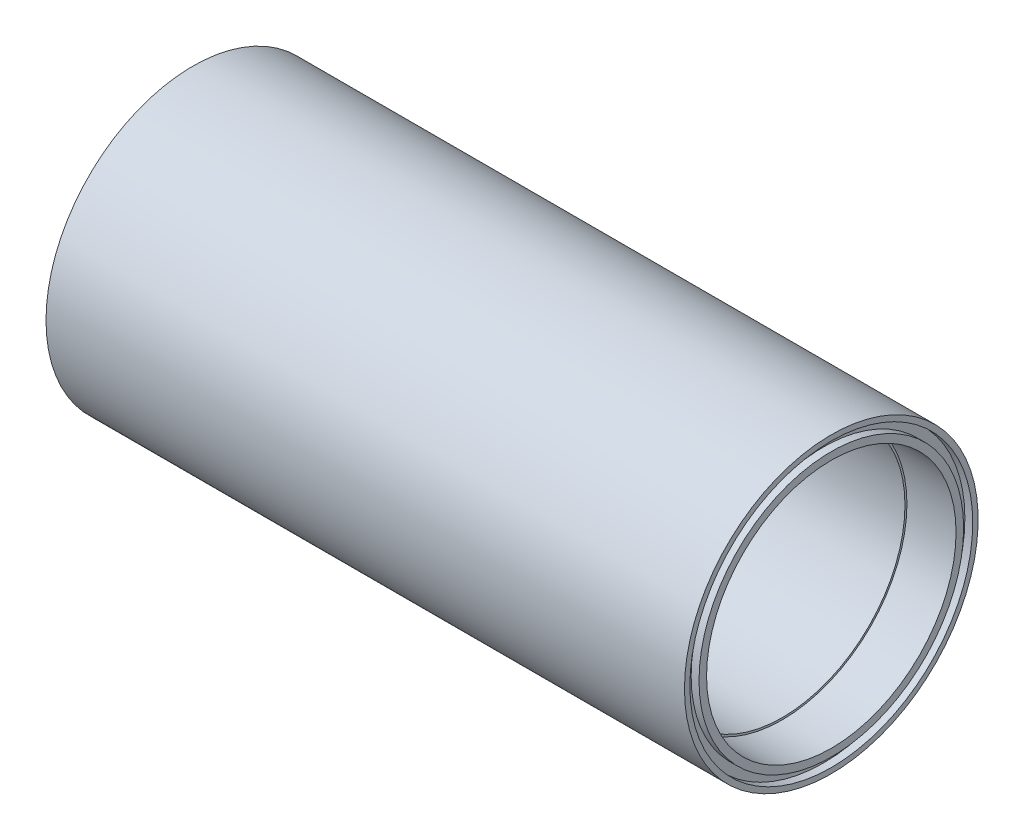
from build123d import *

# Parameters (mm, degrees)
SKETCH2_R          = 36.576
SKETCH2_R_2        = 34.2138
CUT_EXTRUDE1_DEPTH = 2.032


with BuildPart() as part:
    # Sketch1 → Revolve1 (revolve)
    with BuildSketch(Plane.XY, mode=Mode.PRIVATE) as revolve1_sk:
        Polygon((-82.55, 37.973), (-82.55, 32.258), (-69.85, 32.258), (-69.85, 31.75), (69.85, 31.75), (69.85, 32.258), (82.55, 32.258), (82.55, 37.973), align=None)
    revolve(revolve1_sk.sketch.rotate(Axis((0, 0, 0), (1, 0, 0)), 90), axis=Axis((0, 0, 0), (1, 0, 0)))

    # Sketch2 → Cut-Extrude1 (cut)
    with BuildSketch(Plane.ZY.offset(82.55)):
        Circle(SKETCH2_R)
        Circle(SKETCH2_R_2, mode=Mode.SUBTRACT)
    cut_extrude1 = extrude(amount=-CUT_EXTRUDE1_DEPTH, mode=Mode.SUBTRACT)

    # Mirror1: Cut-Extrude1 across plane
    add(cut_extrude1.mirror(Plane(origin=(0, 0, 0), x_dir=(0, 0, 1), z_dir=(1, 0, 0))), mode=Mode.SUBTRACT)


solid = part.part
